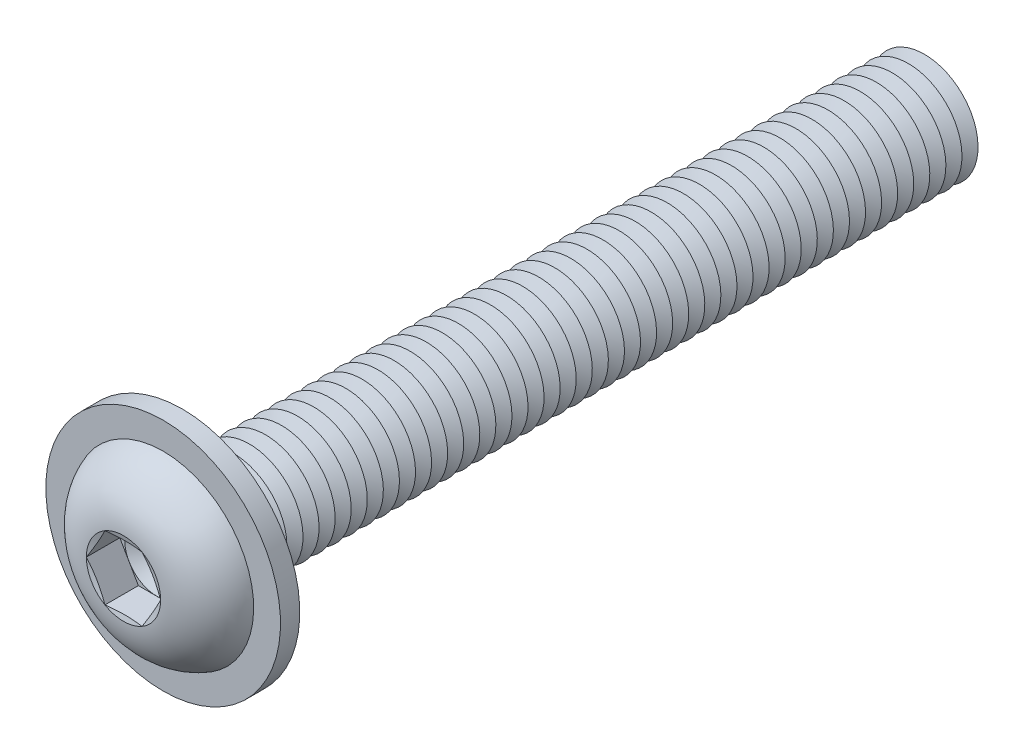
from build123d import *

# Parameters (mm, degrees)
FILLET1_R           = 0.75
LPATTERN1_COUNT     = 46
LPATTERN1_PITCH     = 1.5
CUT_EXTRUDE1_DEPTH  = 3.12
SKETCH5_R           = 10.95
SKETCH5_R_2         = 5.75
BOSS_EXTRUDE1_DEPTH = 1.8


with BuildPart() as part:
    # Sketch1 → Revolve1 (revolve)
    with BuildSketch(Plane(origin=(0, 0, 0), x_dir=(0, 0, -1), z_dir=(1, 0, 0))):
        with BuildLine():
            Line((0, 5), (0, 8.75))
            ThreePointArc((0, 8.75), (-3.814142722, 7.21429474), (-5.5, 3.4641))
            Line((-5.5, 3.4641), (-5.035898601, 1.73205))
            Line((-5.035898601, 1.73205), (-5.5, 1.73205))
            Line((-5.5, 1.73205), (-5.5, 0))
            Line((-5.5, 0), (70, 0))
            Line((70, 0), (70, 5))
            Line((70, 5), (0, 5))
        make_face()
    revolve(axis=Axis((0, 0, -70), (0, 0, 1)))

    # Fillet1
    fillet1_edges = [part.edges().sort_by_distance(p)[0] for p in [
        (0, -5, 0),
    ]]
    fillet(fillet1_edges, radius=FILLET1_R)

    # Sketch2 → Cut-Revolve1 (revolve, cut)
    with BuildSketch(Plane(origin=(0, 0, 0), x_dir=(0, 0, -1), z_dir=(1, 0, 0))):
        Polygon((69.25, 5), (70.75, 5), (70, 3.700961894), align=None)
    cut_revolve1 = revolve(axis=Axis((0, 0, -70), (0, 0, -1)), mode=Mode.SUBTRACT)

    # LPattern1: Cut-Revolve1 ×46
    with Locations(*[(0, 0, i * LPATTERN1_PITCH) for i in range(1, LPATTERN1_COUNT)]):
        add(cut_revolve1, mode=Mode.SUBTRACT)

    # Sketch3 → Cut-Extrude1 (cut)
    with BuildSketch(Plane.XY.offset(5.5)):
        Polygon((1.73205, 2.999998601), (-1.73205, 2.999998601), (-3.4641, 0), (-1.73205, -2.999998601), (1.73205, -2.999998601), (3.4641, 0), align=None)
    extrude(amount=-CUT_EXTRUDE1_DEPTH, mode=Mode.SUBTRACT)

    # Cut-Extrude2 cone 1 section (on through the dimple's axis) → Cut-Extrude2 (revolve, cut)
    with BuildSketch(Plane(origin=(0, 0, 2.38), x_dir=(0, -1, 0), z_dir=(1, 0, 0))):
        Polygon((0, 0), (2.999998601, 0), (0, 1.73205), align=None)
    revolve(axis=Axis((0, 0, 2.38), (0, 0, -1)), mode=Mode.SUBTRACT)

    # Sketch5 → Boss-Extrude1 (add)
    with BuildSketch(Plane(origin=(0, 0, 0), x_dir=(-1, 0, 0), z_dir=(0, 0, -1))):
        with Locations(Location((0, 0, 0), (0, 0, 90))):
            Circle(SKETCH5_R)
        Circle(SKETCH5_R_2, mode=Mode.SUBTRACT)
    extrude(amount=-BOSS_EXTRUDE1_DEPTH)


solid = part.part
